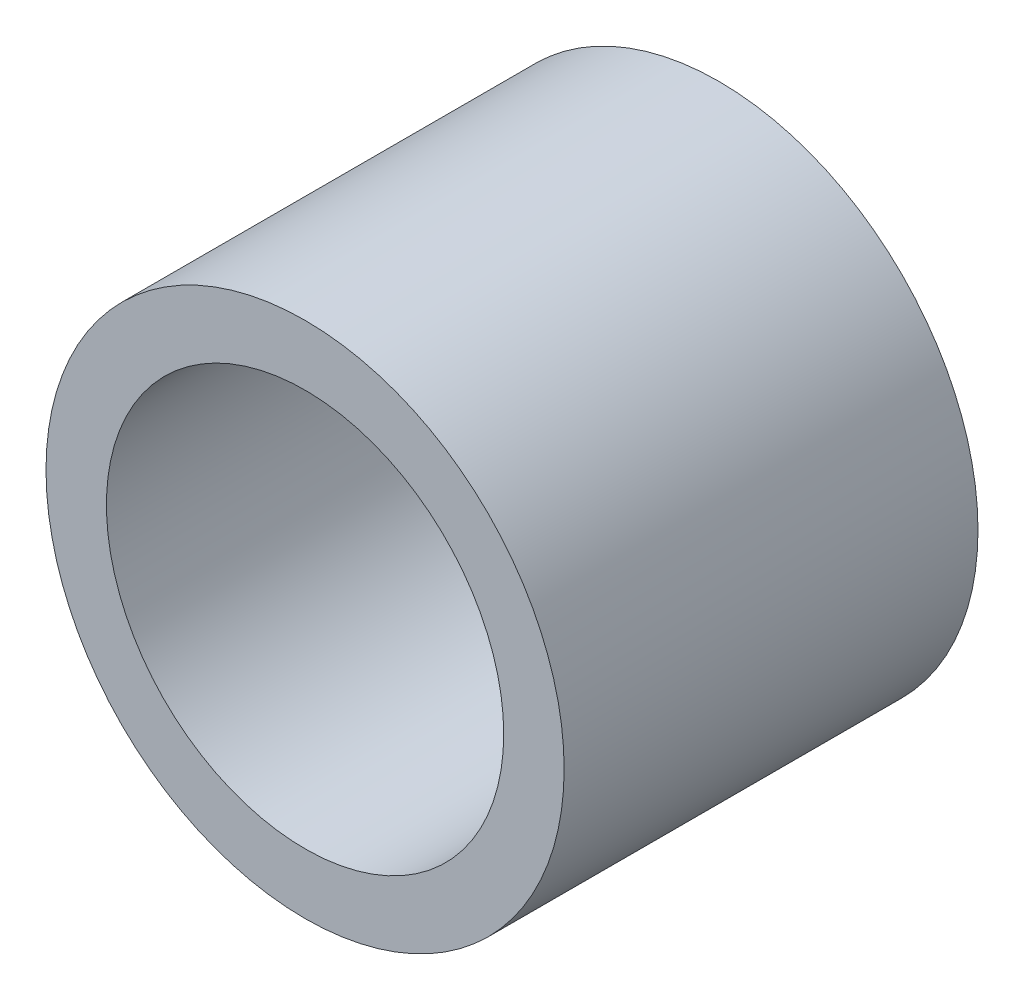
from build123d import *

# Parameters (mm, degrees)
SKETCH1_R          = 3.9751
SKETCH1_R_2        = 2.4257
EXTRUDE1_DEPTH     = 3.175
SKETCH5_R          = 3.048
CUT_EXTRUDE1_DEPTH = 9.480880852


with BuildPart() as part:
    # Sketch1 → Extrude1 (new, symmetric)
    with BuildSketch(Plane.XY):
        Circle(SKETCH1_R)
        Circle(SKETCH1_R_2, mode=Mode.SUBTRACT)
    extrude(amount=EXTRUDE1_DEPTH, both=True)

    # Sketch5 → Cut-Extrude1 (cut, through all)
    with BuildSketch(Plane.XY.offset(3.175)):
        Circle(SKETCH5_R)
    extrude(amount=-CUT_EXTRUDE1_DEPTH, mode=Mode.SUBTRACT)


solid = part.part
